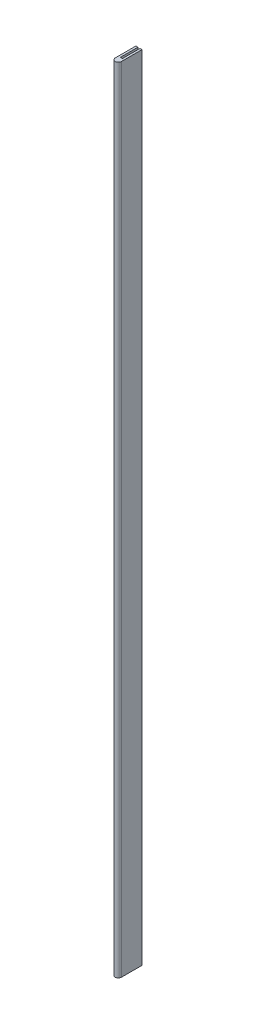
from build123d import *

# Parameters (mm, degrees)
SKETCH1_R           = 2.38125
BOSS_EXTRUDE1_DEPTH = 609.6
SKETCH2_W           = 1.5875
SKETCH2_H           = 15.875
BOSS_EXTRUDE2_DEPTH = 609.6


with BuildPart() as part:
    # Sketch1 → Boss-Extrude1 (new body)
    with BuildSketch(Plane(origin=(0, 0, 0), x_dir=(1, 0, 0), z_dir=(0, 1, 0))):
        with Locations(Location((0, 0, 0), (0, 0, 90))):
            Circle(SKETCH1_R)
    extrude(amount=BOSS_EXTRUDE1_DEPTH)

    # Sketch2 → Boss-Extrude2 (add)
    with BuildSketch(Plane(origin=(0, 609.6, 0), x_dir=(1, 0, 0), z_dir=(0, 1, 0))):
        with Locations((-1.5875, 7.9375)):
            Rectangle(SKETCH2_W, SKETCH2_H)
        with Locations((1.5875, 7.9375)):
            Rectangle(SKETCH2_W, SKETCH2_H)
    extrude(amount=-BOSS_EXTRUDE2_DEPTH)


solid = part.part
